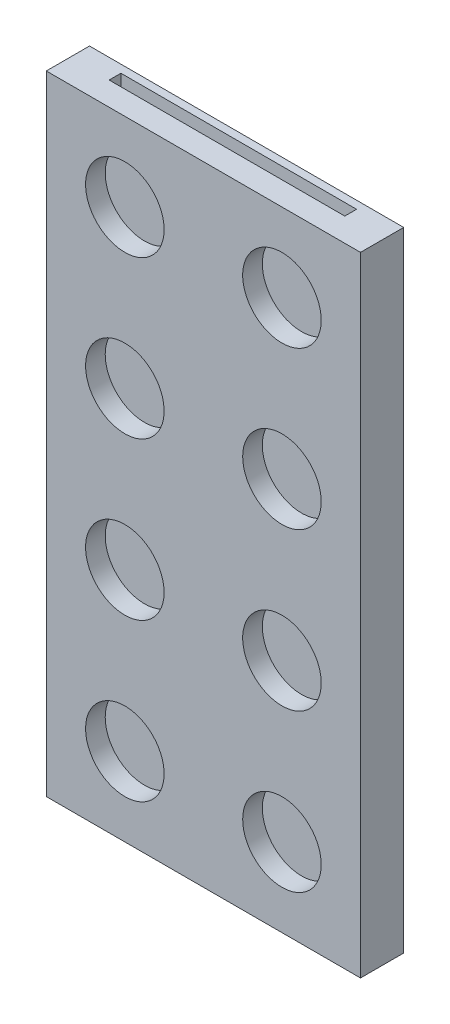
from build123d import *

# Parameters (mm, degrees)
SKETCH1_W           = 50.8
SKETCH1_H           = 101.6
BOSS_EXTRUDE1_DEPTH = 6.985
SKETCH3_R           = 6.35
SKETCH3_R_2         = 2.54
CUT_EXTRUDE2_DEPTH  = 3.175
SKETCH4_W           = 35.56
SKETCH4_H           = 86.36
CUT_EXTRUDE3_DEPTH  = 2.54
SKETCH5_W           = 38.1
SKETCH5_H           = 1.905
CUT_EXTRUDE4_DEPTH  = 95.25


with BuildPart() as part:
    # Sketch1 → Boss-Extrude1 (new body)
    with BuildSketch(Plane.XY):
        with Locations((25.4, 50.8)):
            Rectangle(SKETCH1_W, SKETCH1_H)
    extrude(amount=BOSS_EXTRUDE1_DEPTH)

    # Sketch3 → Cut-Extrude2 (cut)
    with BuildSketch(Plane.XY.offset(6.985)):
        with Locations((12.7, 139.7)):
            Circle(SKETCH3_R)
        with Locations((38.1, 139.7)):
            Circle(SKETCH3_R)
        with Locations((63.5, 139.7)):
            Circle(SKETCH3_R_2)
        with Locations((88.9, 139.7)):
            Circle(SKETCH3_R_2)
        with Locations((88.9, 114.3)):
            Circle(SKETCH3_R_2)
        with Locations((63.5, 114.3)):
            Circle(SKETCH3_R_2)
        with Locations((38.1, 114.3)):
            Circle(SKETCH3_R)
        with Locations((12.7, 114.3)):
            Circle(SKETCH3_R)
        with Locations((88.9, 88.9)):
            Circle(SKETCH3_R_2)
        with Locations((63.5, 88.9)):
            Circle(SKETCH3_R_2)
        with Locations((38.1, 88.9)):
            Circle(SKETCH3_R)
        with Locations((12.7, 88.9)):
            Circle(SKETCH3_R)
        with Locations((88.9, 63.5)):
            Circle(SKETCH3_R_2)
        with Locations((63.5, 63.5)):
            Circle(SKETCH3_R_2)
        with Locations(Location((38.1, 63.5, 0), (0, 0, 180))):
            Circle(SKETCH3_R)
        with Locations(Location((12.7, 63.5, 0), (0, 0, 180))):
            Circle(SKETCH3_R)
        with Locations((88.9, 38.1)):
            Circle(SKETCH3_R_2)
        with Locations((63.5, 38.1)):
            Circle(SKETCH3_R_2)
        with Locations((38.1, 38.1)):
            Circle(SKETCH3_R)
        with Locations((12.7, 38.1)):
            Circle(SKETCH3_R)
        with Locations((88.9, 12.7)):
            Circle(SKETCH3_R_2)
        with Locations((63.5, 12.7)):
            Circle(SKETCH3_R_2)
        with Locations(Location((38.1, 12.7, 0), (0, 0, 180))):
            Circle(SKETCH3_R)
        with Locations(Location((12.7, 12.7, 0), (0, 0, 180))):
            Circle(SKETCH3_R)
    extrude(amount=-CUT_EXTRUDE2_DEPTH, mode=Mode.SUBTRACT)

    # Sketch4 → Cut-Extrude3 (cut)
    with BuildSketch(Plane(origin=(0, 0, 0), x_dir=(-1, 0, 0), z_dir=(0, 0, -1))):
        with Locations((-25.4, 50.8)):
            Rectangle(SKETCH4_W, SKETCH4_H)
    extrude(amount=-CUT_EXTRUDE3_DEPTH, mode=Mode.SUBTRACT)

    # Sketch5 → Cut-Extrude4 (cut)
    with BuildSketch(Plane(origin=(0, 101.6, 0), x_dir=(1, 0, 0), z_dir=(0, 1, 0))):
        with Locations((25.4, -2.2225)):
            Rectangle(SKETCH5_W, SKETCH5_H)
    extrude(amount=-CUT_EXTRUDE4_DEPTH, mode=Mode.SUBTRACT)


solid = part.part
